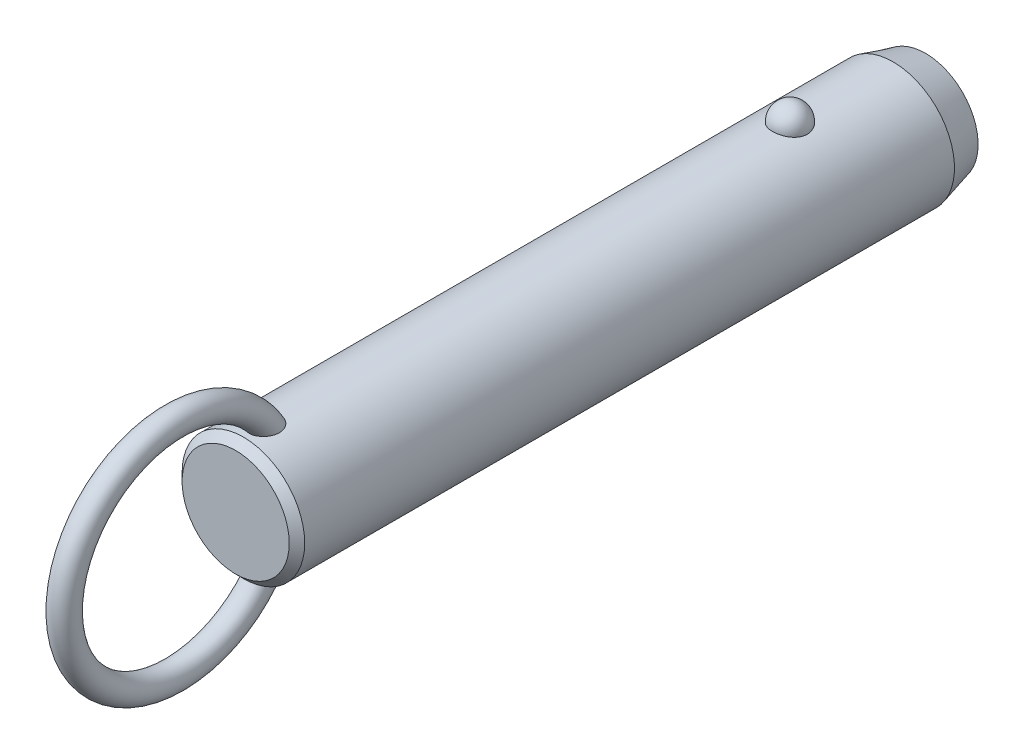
ISO-10303-21;
HEADER;
FILE_DESCRIPTION(('STEP AP214'),'2;1');
FILE_NAME('part.step','',(''),(''),'','','');
FILE_SCHEMA(('AUTOMOTIVE_DESIGN { 1 0 10303 214 1 1 1 1 }'));
ENDSEC;
DATA;
#1=APPLICATION_CONTEXT('core data for automotive mechanical design processes');
#2=APPLICATION_PROTOCOL_DEFINITION('international standard','automotive_design',2000,#1);
#3=PRODUCT_CONTEXT('',#1,'mechanical');
#4=PRODUCT('Part','Part','',(#3));
#5=PRODUCT_RELATED_PRODUCT_CATEGORY('part','',(#4));
#6=PRODUCT_DEFINITION_FORMATION('','',#4);
#7=PRODUCT_DEFINITION_CONTEXT('part definition',#1,'design');
#8=PRODUCT_DEFINITION('design','',#6,#7);
#9=PRODUCT_DEFINITION_SHAPE('','',#8);
#10=(LENGTH_UNIT() NAMED_UNIT(*) SI_UNIT(.MILLI.,.METRE.));
#11=(NAMED_UNIT(*) PLANE_ANGLE_UNIT() SI_UNIT($,.RADIAN.));
#12=(NAMED_UNIT(*) SI_UNIT($,.STERADIAN.) SOLID_ANGLE_UNIT());
#13=UNCERTAINTY_MEASURE_WITH_UNIT(LENGTH_MEASURE(1.E-05),#10,'distance_accuracy_value','');
#14=(GEOMETRIC_REPRESENTATION_CONTEXT(3) GLOBAL_UNCERTAINTY_ASSIGNED_CONTEXT((#13)) GLOBAL_UNIT_ASSIGNED_CONTEXT((#10,
#11,#12)) REPRESENTATION_CONTEXT('',''));
#15=CARTESIAN_POINT('',(0.,0.,0.));
#16=DIRECTION('',(0.,0.,1.));
#17=DIRECTION('',(1.,0.,0.));
#18=AXIS2_PLACEMENT_3D('',#15,#16,#17);
#19=CARTESIAN_POINT('',(0.,0.,73.7));
#20=DIRECTION('',(0.,0.,-1.));
#21=DIRECTION('',(-1.,0.,0.));
#22=AXIS2_PLACEMENT_3D('',#19,#20,#21);
#23=CYLINDRICAL_SURFACE('',#22,9.5);
#24=CARTESIAN_POINT('',(2.67259918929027,9.11631578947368,-2.70000000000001));
#25=CARTESIAN_POINT('',(2.6725968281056,9.11631786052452,-2.54909854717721));
#26=CARTESIAN_POINT('',(2.66030567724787,9.11994722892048,-2.39816735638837));
#27=CARTESIAN_POINT('',(2.6114347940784,9.13405924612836,-2.10058568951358));
#28=CARTESIAN_POINT('',(2.57484658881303,9.14454428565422,-1.95393672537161));
#29=CARTESIAN_POINT('',(2.47830875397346,9.17117631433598,-1.66916069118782));
#30=CARTESIAN_POINT('',(2.41836936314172,9.18732082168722,-1.53102991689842));
#31=CARTESIAN_POINT('',(2.27661331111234,9.22346780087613,-1.26705393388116));
#32=CARTESIAN_POINT('',(2.19479699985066,9.24347021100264,-1.14120852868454));
#33=CARTESIAN_POINT('',(2.01085282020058,9.28522401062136,-0.904632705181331));
#34=CARTESIAN_POINT('',(1.90862396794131,9.30698376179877,-0.793982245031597));
#35=CARTESIAN_POINT('',(1.6867437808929,9.34973971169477,-0.591607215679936));
#36=CARTESIAN_POINT('',(1.56709244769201,9.37073591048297,-0.499882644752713));
#37=CARTESIAN_POINT('',(1.31393976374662,9.40956370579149,-0.338167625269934));
#38=CARTESIAN_POINT('',(1.18048026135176,9.42740444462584,-0.268113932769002));
#39=CARTESIAN_POINT('',(0.903154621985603,9.45799906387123,-0.151390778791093));
#40=CARTESIAN_POINT('',(0.759289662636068,9.47075351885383,-0.104718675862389));
#41=CARTESIAN_POINT('',(0.468074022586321,9.48956256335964,-0.0367633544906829));
#42=CARTESIAN_POINT('',(0.320836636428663,9.49573643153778,-0.0150275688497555));
#43=CARTESIAN_POINT('',(0.0246714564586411,9.50112183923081,0.00396199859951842));
#44=CARTESIAN_POINT('',(-0.124256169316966,9.50033406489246,0.00121819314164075));
#45=CARTESIAN_POINT('',(-0.417264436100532,9.4919475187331,-0.0284441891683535));
#46=CARTESIAN_POINT('',(-0.56138413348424,9.48444885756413,-0.0550074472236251));
#47=CARTESIAN_POINT('',(-0.842986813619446,9.46357853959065,-0.131064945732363));
#48=CARTESIAN_POINT('',(-0.980469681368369,9.450206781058,-0.180559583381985));
#49=CARTESIAN_POINT('',(-1.24585005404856,9.41890822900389,-0.301476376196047));
#50=CARTESIAN_POINT('',(-1.37368611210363,9.40095498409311,-0.373026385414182));
#51=CARTESIAN_POINT('',(-1.61552738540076,9.36242964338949,-0.536025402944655));
#52=CARTESIAN_POINT('',(-1.72953116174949,9.34185727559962,-0.627476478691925));
#53=CARTESIAN_POINT('',(-1.9429225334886,9.29984568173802,-0.829844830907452));
#54=CARTESIAN_POINT('',(-2.04198021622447,9.27839736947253,-0.94110821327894));
#55=CARTESIAN_POINT('',(-2.22026460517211,9.23735994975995,-1.17883414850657));
#56=CARTESIAN_POINT('',(-2.29948985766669,9.21777097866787,-1.30529781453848));
#57=CARTESIAN_POINT('',(-2.43697287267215,9.18238994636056,-1.57158566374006));
#58=CARTESIAN_POINT('',(-2.49497068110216,9.16664569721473,-1.71155057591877));
#59=CARTESIAN_POINT('',(-2.5872073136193,9.14104303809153,-1.99961197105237));
#60=CARTESIAN_POINT('',(-2.62144683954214,9.13118445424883,-2.14770821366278));
#61=CARTESIAN_POINT('',(-2.66521466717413,9.11850622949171,-2.44715424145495));
#62=CARTESIAN_POINT('',(-2.67484831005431,9.11565658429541,-2.59848735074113));
#63=CARTESIAN_POINT('',(-2.66946735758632,9.11723375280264,-2.90067317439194));
#64=CARTESIAN_POINT('',(-2.65445345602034,9.12166036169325,-3.05152590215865));
#65=CARTESIAN_POINT('',(-2.60029711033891,9.13724422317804,-3.34766110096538));
#66=CARTESIAN_POINT('',(-2.56127978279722,9.14836656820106,-3.49296833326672));
#67=CARTESIAN_POINT('',(-2.46018844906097,9.17606676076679,-3.77477535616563));
#68=CARTESIAN_POINT('',(-2.39811349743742,9.1926448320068,-3.9112747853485));
#69=CARTESIAN_POINT('',(-2.25202303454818,9.22952198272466,-4.17244273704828));
#70=CARTESIAN_POINT('',(-2.16788714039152,9.24984129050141,-4.29704106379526));
#71=CARTESIAN_POINT('',(-1.9799408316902,9.29188255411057,-4.53013066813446));
#72=CARTESIAN_POINT('',(-1.87612963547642,9.31360456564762,-4.63862130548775));
#73=CARTESIAN_POINT('',(-1.65105429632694,9.35612959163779,-4.8369029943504));
#74=CARTESIAN_POINT('',(-1.52972405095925,9.37692871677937,-4.92661991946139));
#75=CARTESIAN_POINT('',(-1.27318250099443,9.41518970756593,-5.08429106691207));
#76=CARTESIAN_POINT('',(-1.13797219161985,9.432651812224,-5.15224684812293));
#77=CARTESIAN_POINT('',(-0.859280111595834,9.46208255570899,-5.26371827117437));
#78=CARTESIAN_POINT('',(-0.715925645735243,9.47411833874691,-5.30753421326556));
#79=CARTESIAN_POINT('',(-0.423550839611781,9.4916822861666,-5.37076321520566));
#80=CARTESIAN_POINT('',(-0.2745312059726,9.49721125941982,-5.39017930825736));
#81=CARTESIAN_POINT('',(0.0218446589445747,9.50110860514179,-5.40390587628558));
#82=CARTESIAN_POINT('',(0.16917707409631,9.49961381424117,-5.39869609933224));
#83=CARTESIAN_POINT('',(0.460808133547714,9.48993906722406,-5.36441955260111));
#84=CARTESIAN_POINT('',(0.605106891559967,9.48175936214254,-5.33535367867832));
#85=CARTESIAN_POINT('',(0.886027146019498,9.4596376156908,-5.25435587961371));
#86=CARTESIAN_POINT('',(1.02267710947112,9.44571881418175,-5.20251612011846));
#87=CARTESIAN_POINT('',(1.28523827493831,9.41358993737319,-5.07741549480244));
#88=CARTESIAN_POINT('',(1.41114877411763,9.39537958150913,-5.00415322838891));
#89=CARTESIAN_POINT('',(1.65085227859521,9.3562644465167,-4.83684599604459));
#90=CARTESIAN_POINT('',(1.76442346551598,9.33532178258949,-4.74249218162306));
#91=CARTESIAN_POINT('',(1.97425672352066,9.29321198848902,-4.53620389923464));
#92=CARTESIAN_POINT('',(2.07051582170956,9.27204482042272,-4.42426641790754));
#93=CARTESIAN_POINT('',(2.24490086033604,9.23139221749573,-4.18363183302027));
#94=CARTESIAN_POINT('',(2.32267019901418,9.21194380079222,-4.05466990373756));
#95=CARTESIAN_POINT('',(2.45584092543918,9.1773419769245,-3.78517836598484));
#96=CARTESIAN_POINT('',(2.5112497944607,9.16218713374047,-3.64465264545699));
#97=CARTESIAN_POINT('',(2.59380876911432,9.13913522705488,-3.37104301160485));
#98=CARTESIAN_POINT('',(2.62330266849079,9.13064624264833,-3.23871053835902));
#99=CARTESIAN_POINT('',(2.66269870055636,9.11923566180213,-2.97092664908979));
#100=CARTESIAN_POINT('',(2.67260130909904,9.11631393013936,-2.83547530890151));
#101=CARTESIAN_POINT('',(2.67259918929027,9.11631578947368,-2.70000000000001));
#102=B_SPLINE_CURVE_WITH_KNOTS('',3,(#24,#25,#26,#27,#28,#29,#30,#31,#32,#33,#34,#35,#36,#37,
#38,#39,#40,#41,#42,#43,#44,#45,#46,#47,#48,#49,#50,#51,#52,#53,#54,#55,#56,#57,#58,#59,#60,#61,
#62,#63,#64,#65,#66,#67,#68,#69,#70,#71,#72,#73,#74,#75,#76,#77,#78,#79,#80,#81,#82,#83,#84,#85,
#86,#87,#88,#89,#90,#91,#92,#93,#94,#95,#96,#97,#98,#99,#100,#101),.UNSPECIFIED.,.T.,.F.,(4,2,2,
2,2,2,2,2,2,2,2,2,2,2,2,2,2,2,2,2,2,2,2,2,2,2,2,2,2,2,2,2,2,2,2,2,2,2,4),(0.,0.452217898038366,
0.904593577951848,1.35677112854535,1.80894144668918,2.26340676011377,2.71787203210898,
3.17099820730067,3.62407318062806,4.0687883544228,4.51345969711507,4.95160616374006,
5.38976021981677,5.83050358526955,6.27129275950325,6.72071308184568,7.17016633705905,
7.62495278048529,8.07972578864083,8.53254856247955,8.98535859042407,9.43582813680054,
9.88631615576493,10.3393155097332,10.7923328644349,11.2471065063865,11.7018475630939,
12.150795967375,12.599688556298,13.0398725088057,13.4800399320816,13.9184421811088,
14.3568730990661,14.802202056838,15.2476074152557,15.7010097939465,16.1542603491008,
16.5602594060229,16.966248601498),.UNSPECIFIED.);
#103=CARTESIAN_POINT('',(2.67259918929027,9.11631578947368,-2.70000000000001));
#104=VERTEX_POINT('',#103);
#105=EDGE_CURVE('E41',#104,#104,#102,.T.);
#106=ORIENTED_EDGE('',*,*,#105,.T.);
#107=EDGE_LOOP('',(#106));
#108=FACE_BOUND('',#107,.T.);
#109=CARTESIAN_POINT('',(0.,0.,82.02));
#110=DIRECTION('',(0.,0.,1.));
#111=DIRECTION('',(1.,0.,0.));
#112=AXIS2_PLACEMENT_3D('',#109,#110,#111);
#113=CIRCLE('',#112,9.5);
#114=CARTESIAN_POINT('',(9.5,0.,82.02));
#115=VERTEX_POINT('',#114);
#116=EDGE_CURVE('E10',#115,#115,#113,.F.);
#117=ORIENTED_EDGE('',*,*,#116,.T.);
#118=EDGE_LOOP('',(#117));
#119=FACE_BOUND('',#118,.T.);
#120=CARTESIAN_POINT('',(-0.697062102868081,-9.47439269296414,76.3678088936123));
#121=CARTESIAN_POINT('',(-0.799579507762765,-9.46685146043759,76.4074823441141));
#122=CARTESIAN_POINT('',(-0.898575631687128,-9.45788043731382,76.4559309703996));
#123=CARTESIAN_POINT('',(-1.08670047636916,-9.43811593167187,76.5688685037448));
#124=CARTESIAN_POINT('',(-1.17583204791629,-9.42732297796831,76.633352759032));
#125=CARTESIAN_POINT('',(-1.34179806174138,-9.40513672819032,76.7762099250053));
#126=CARTESIAN_POINT('',(-1.41865133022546,-9.39374438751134,76.854561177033));
#127=CARTESIAN_POINT('',(-1.5586004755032,-9.37154196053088,77.0227524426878));
#128=CARTESIAN_POINT('',(-1.62169476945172,-9.3607319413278,77.1125937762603));
#129=CARTESIAN_POINT('',(-1.73527695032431,-9.34035749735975,77.3045001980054));
#130=CARTESIAN_POINT('',(-1.7852226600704,-9.33085270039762,77.4068910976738));
#131=CARTESIAN_POINT('',(-1.86924997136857,-9.3143834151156,77.618148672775));
#132=CARTESIAN_POINT('',(-1.90332570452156,-9.30741986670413,77.7270177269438));
#133=CARTESIAN_POINT('',(-1.95893603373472,-9.29588482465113,77.9604730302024));
#134=CARTESIAN_POINT('',(-1.97872420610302,-9.29165182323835,78.0854890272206));
#135=CARTESIAN_POINT('',(-2.00062129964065,-9.28695978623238,78.3370805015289));
#136=CARTESIAN_POINT('',(-2.00272284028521,-9.28650232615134,78.463656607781));
#137=CARTESIAN_POINT('',(-1.98958876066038,-9.28932750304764,78.7368157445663));
#138=CARTESIAN_POINT('',(-1.97143366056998,-9.2932400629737,78.8832519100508));
#139=CARTESIAN_POINT('',(-1.91479925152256,-9.30507151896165,79.1720629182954));
#140=CARTESIAN_POINT('',(-1.87629122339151,-9.31299607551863,79.314431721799));
#141=CARTESIAN_POINT('',(-1.77225683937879,-9.33340232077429,79.6151725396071));
#142=CARTESIAN_POINT('',(-1.70334898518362,-9.34641636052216,79.7723691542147));
#143=CARTESIAN_POINT('',(-1.58111062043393,-9.36759153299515,79.9975171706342));
#144=CARTESIAN_POINT('',(-1.53721459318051,-9.37492619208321,80.0707968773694));
#145=CARTESIAN_POINT('',(-1.44302631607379,-9.38988566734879,80.2130740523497));
#146=CARTESIAN_POINT('',(-1.39273721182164,-9.39751033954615,80.2820736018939));
#147=CARTESIAN_POINT('',(-1.26775962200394,-9.41530678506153,80.4369832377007));
#148=CARTESIAN_POINT('',(-1.19052326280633,-9.42548108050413,80.5208712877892));
#149=CARTESIAN_POINT('',(-1.02420241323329,-9.44499825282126,80.6760086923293));
#150=CARTESIAN_POINT('',(-0.935139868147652,-9.45434261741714,80.7472808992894));
#151=CARTESIAN_POINT('',(-0.766610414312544,-9.46930670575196,80.8586955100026));
#152=CARTESIAN_POINT('',(-0.689439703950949,-9.47529223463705,80.9022354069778));
#153=CARTESIAN_POINT('',(-0.528942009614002,-9.48560294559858,80.9763133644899));
#154=CARTESIAN_POINT('',(-0.445620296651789,-9.48992953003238,81.0068624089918));
#155=CARTESIAN_POINT('',(-0.273901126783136,-9.49644161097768,81.0525792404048));
#156=CARTESIAN_POINT('',(-0.185465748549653,-9.49860811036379,81.06761059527));
#157=CARTESIAN_POINT('',(-0.00734541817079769,-9.5004135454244,81.0801494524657));
#158=CARTESIAN_POINT('',(0.0823387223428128,-9.50005405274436,81.0776678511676));
#159=CARTESIAN_POINT('',(0.247679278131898,-9.49708301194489,81.0569959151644));
#160=CARTESIAN_POINT('',(0.323620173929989,-9.49477609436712,81.0409300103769));
#161=CARTESIAN_POINT('',(0.471981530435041,-9.48855917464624,80.9971726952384));
#162=CARTESIAN_POINT('',(0.544400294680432,-9.48464840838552,80.9694757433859));
#163=CARTESIAN_POINT('',(0.708947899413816,-9.47398336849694,80.8928026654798));
#164=CARTESIAN_POINT('',(0.799149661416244,-9.46671310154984,80.8397745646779));
#165=CARTESIAN_POINT('',(0.969783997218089,-9.45076225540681,80.7199731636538));
#166=CARTESIAN_POINT('',(1.05019415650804,-9.44207854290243,80.6531692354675));
#167=CARTESIAN_POINT('',(1.23092343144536,-9.42051459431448,80.4807596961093));
#168=CARTESIAN_POINT('',(1.32652499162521,-9.40733378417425,80.3702619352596));
#169=CARTESIAN_POINT('',(1.49893121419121,-9.38140745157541,80.1355614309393));
#170=CARTESIAN_POINT('',(1.57571616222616,-9.36866239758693,80.0113445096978));
#171=CARTESIAN_POINT('',(1.71285426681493,-9.34457644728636,79.7493891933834));
#172=CARTESIAN_POINT('',(1.77266365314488,-9.33328726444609,79.6113623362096));
#173=CARTESIAN_POINT('',(1.87239208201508,-9.31379209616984,79.3280515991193));
#174=CARTESIAN_POINT('',(1.91230158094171,-9.3055875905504,79.182764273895));
#175=CARTESIAN_POINT('',(1.9760418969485,-9.29228394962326,78.8620281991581));
#176=CARTESIAN_POINT('',(1.99587438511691,-9.28797202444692,78.6857248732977));
#177=CARTESIAN_POINT('',(2.0029570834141,-9.28645519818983,78.3324146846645));
#178=CARTESIAN_POINT('',(1.99025930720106,-9.28923895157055,78.1554093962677));
#179=CARTESIAN_POINT('',(1.93735479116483,-9.30038134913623,77.8563381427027));
#180=CARTESIAN_POINT('',(1.90576827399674,-9.30697680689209,77.7326679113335));
#181=CARTESIAN_POINT('',(1.82287484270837,-9.32356855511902,77.492329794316));
#182=CARTESIAN_POINT('',(1.77158213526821,-9.33356239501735,77.3756569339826));
#183=CARTESIAN_POINT('',(1.6488574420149,-9.35602275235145,77.1527061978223));
#184=CARTESIAN_POINT('',(1.57730995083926,-9.36850332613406,77.0464927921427));
#185=CARTESIAN_POINT('',(1.41543264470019,-9.39431873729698,76.8495530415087));
#186=CARTESIAN_POINT('',(1.32510883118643,-9.40765330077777,76.7588217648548));
#187=CARTESIAN_POINT('',(1.13846223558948,-9.43195720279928,76.6050334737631));
#188=CARTESIAN_POINT('',(1.0436989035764,-9.44302894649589,76.5400947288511));
#189=CARTESIAN_POINT('',(0.843965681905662,-9.46296805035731,76.4280388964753));
#190=CARTESIAN_POINT('',(0.739000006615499,-9.47183631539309,76.3809144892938));
#191=CARTESIAN_POINT('',(0.528175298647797,-9.48586140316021,76.3081173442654));
#192=CARTESIAN_POINT('',(0.422686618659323,-9.49119633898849,76.2814024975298));
#193=CARTESIAN_POINT('',(0.208590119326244,-9.49831365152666,76.2460137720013));
#194=CARTESIAN_POINT('',(0.0999817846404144,-9.500095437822,76.2373428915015));
#195=CARTESIAN_POINT('',(-0.126104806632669,-9.49988861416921,76.2383501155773));
#196=CARTESIAN_POINT('',(-0.243578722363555,-9.49757821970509,76.2495942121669));
#197=CARTESIAN_POINT('',(-0.474390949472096,-9.48885165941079,76.293167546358));
#198=CARTESIAN_POINT('',(-0.587729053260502,-9.48243528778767,76.3254978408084));
#199=CARTESIAN_POINT('',(-0.697062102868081,-9.47439269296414,76.3678088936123));
#200=B_SPLINE_CURVE_WITH_KNOTS('',3,(#120,#121,#122,#123,#124,#125,#126,#127,#128,#129,#130,
#131,#132,#133,#134,#135,#136,#137,#138,#139,#140,#141,#142,#143,#144,#145,#146,#147,#148,#149,
#150,#151,#152,#153,#154,#155,#156,#157,#158,#159,#160,#161,#162,#163,#164,#165,#166,#167,#168,
#169,#170,#171,#172,#173,#174,#175,#176,#177,#178,#179,#180,#181,#182,#183,#184,#185,#186,#187,
#188,#189,#190,#191,#192,#193,#194,#195,#196,#197,#198,#199),.UNSPECIFIED.,.T.,.F.,(4,2,2,2,2,2,
2,2,2,2,2,2,2,2,2,2,2,2,2,2,2,2,2,2,2,2,2,2,2,2,2,2,2,2,2,2,2,2,2,4),(0.,0.330119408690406,
0.660143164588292,0.989655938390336,1.31920659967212,1.66074728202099,2.00241415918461,
2.38088696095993,2.75951768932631,3.20065679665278,3.6424200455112,4.15620996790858,
4.41314162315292,4.66994734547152,5.01228664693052,5.35399933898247,5.6194303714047,
5.88463652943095,6.15215502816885,6.41950709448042,6.65144391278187,6.88349136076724,
7.19641200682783,7.51003602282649,7.9477971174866,8.38601491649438,8.83699707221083,
9.28819530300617,9.8177866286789,10.3465317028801,10.7284172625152,11.110028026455,
11.4938603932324,11.8775702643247,12.2220189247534,12.5663259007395,12.8915939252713,
13.2169159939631,13.5689650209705,13.9210316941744),.UNSPECIFIED.);
#201=CARTESIAN_POINT('',(-0.697062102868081,-9.47439269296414,76.3678088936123));
#202=VERTEX_POINT('',#201);
#203=EDGE_CURVE('E60',#202,#202,#200,.T.);
#204=ORIENTED_EDGE('',*,*,#203,.T.);
#205=EDGE_LOOP('',(#204));
#206=FACE_BOUND('',#205,.T.);
#207=CARTESIAN_POINT('',(-0.697062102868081,9.47439269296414,76.3678088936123));
#208=CARTESIAN_POINT('',(-0.597792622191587,9.48169483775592,76.3293956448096));
#209=CARTESIAN_POINT('',(-0.495106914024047,9.48766580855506,76.2991682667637));
#210=CARTESIAN_POINT('',(-0.285876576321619,9.49627648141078,76.2560327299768));
#211=CARTESIAN_POINT('',(-0.179324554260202,9.49890941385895,76.2431597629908));
#212=CARTESIAN_POINT('',(0.0344157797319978,9.50053798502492,76.2351666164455));
#213=CARTESIAN_POINT('',(0.141603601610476,9.49953613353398,76.2400341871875));
#214=CARTESIAN_POINT('',(0.353563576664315,9.49401038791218,76.2673654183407));
#215=CARTESIAN_POINT('',(0.458336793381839,9.48948807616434,76.28982117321));
#216=CARTESIAN_POINT('',(0.66249373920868,9.4774236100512,76.3516719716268));
#217=CARTESIAN_POINT('',(0.761881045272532,9.46988348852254,76.3910556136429));
#218=CARTESIAN_POINT('',(0.952608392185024,9.45260382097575,76.4856342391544));
#219=CARTESIAN_POINT('',(1.04394806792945,9.44286417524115,76.5408299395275));
#220=CARTESIAN_POINT('',(1.21712767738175,9.4221176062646,76.6660662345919));
#221=CARTESIAN_POINT('',(1.29885671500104,9.41109835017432,76.7362579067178));
#222=CARTESIAN_POINT('',(1.44978975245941,9.38903310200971,76.888980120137));
#223=CARTESIAN_POINT('',(1.51899278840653,9.37798710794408,76.9715116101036));
#224=CARTESIAN_POINT('',(1.64602857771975,9.35654375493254,77.1497763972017));
#225=CARTESIAN_POINT('',(1.70333052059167,9.34618688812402,77.2458916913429));
#226=CARTESIAN_POINT('',(1.80259341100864,9.32755128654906,77.445897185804));
#227=CARTESIAN_POINT('',(1.84454942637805,9.31927322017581,77.5497898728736));
#228=CARTESIAN_POINT('',(1.91637039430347,9.30478365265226,77.772213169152));
#229=CARTESIAN_POINT('',(1.944805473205,9.29882552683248,77.8912192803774));
#230=CARTESIAN_POINT('',(1.98449865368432,9.29043398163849,78.1321436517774));
#231=CARTESIAN_POINT('',(1.99574908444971,9.28800213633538,78.2540631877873));
#232=CARTESIAN_POINT('',(2.00275141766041,9.28649645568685,78.5169324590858));
#233=CARTESIAN_POINT('',(1.99588238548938,9.28799035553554,78.6579529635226));
#234=CARTESIAN_POINT('',(1.96270559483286,9.29505517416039,78.9376217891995));
#235=CARTESIAN_POINT('',(1.93637872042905,9.30063010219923,79.076267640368));
#236=CARTESIAN_POINT('',(1.85949176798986,9.31633564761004,79.3725616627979));
#237=CARTESIAN_POINT('',(1.80549792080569,9.3270926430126,79.5292907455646));
#238=CARTESIAN_POINT('',(1.67376869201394,9.35163064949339,79.8322840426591));
#239=CARTESIAN_POINT('',(1.59603181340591,9.36541185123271,79.9785475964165));
#240=CARTESIAN_POINT('',(1.4360277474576,9.39110706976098,80.2258138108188));
#241=CARTESIAN_POINT('',(1.35831795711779,9.40278656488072,80.329791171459));
#242=CARTESIAN_POINT('',(1.18774483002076,9.42585025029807,80.5245347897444));
#243=CARTESIAN_POINT('',(1.09490932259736,9.43723493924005,80.6153247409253));
#244=CARTESIAN_POINT('',(0.921110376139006,9.45552616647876,80.7562033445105));
#245=CARTESIAN_POINT('',(0.843738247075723,9.46281058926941,80.8106563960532));
#246=CARTESIAN_POINT('',(0.681245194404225,9.47589120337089,80.9067117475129));
#247=CARTESIAN_POINT('',(0.596135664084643,9.48168953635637,80.9483325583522));
#248=CARTESIAN_POINT('',(0.433779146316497,9.49038144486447,81.0100899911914));
#249=CARTESIAN_POINT('',(0.357459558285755,9.49359170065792,81.0326013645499));
#250=CARTESIAN_POINT('',(0.202074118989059,9.49816761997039,81.0645745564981));
#251=CARTESIAN_POINT('',(0.123010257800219,9.49953459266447,81.0740456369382));
#252=CARTESIAN_POINT('',(-0.0357372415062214,9.50026497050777,81.0791143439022));
#253=CARTESIAN_POINT('',(-0.115421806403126,9.49962433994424,81.0746840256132));
#254=CARTESIAN_POINT('',(-0.272823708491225,9.49640854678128,81.0522962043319));
#255=CARTESIAN_POINT('',(-0.350540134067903,9.4938325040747,81.0343325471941));
#256=CARTESIAN_POINT('',(-0.500580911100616,9.4870946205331,80.9868028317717));
#257=CARTESIAN_POINT('',(-0.572979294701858,9.48296359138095,80.9574618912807));
#258=CARTESIAN_POINT('',(-0.712864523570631,9.47347609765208,80.8890087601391));
#259=CARTESIAN_POINT('',(-0.780349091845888,9.46811906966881,80.8498920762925));
#260=CARTESIAN_POINT('',(-0.94630921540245,9.45329720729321,80.739432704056));
#261=CARTESIAN_POINT('',(-1.04090230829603,9.44321512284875,80.6623297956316));
#262=CARTESIAN_POINT('',(-1.21661929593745,9.42219227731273,80.4940971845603));
#263=CARTESIAN_POINT('',(-1.2977051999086,9.41124921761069,80.4029292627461));
#264=CARTESIAN_POINT('',(-1.47319646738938,9.38563439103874,80.1761621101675));
#265=CARTESIAN_POINT('',(-1.56208878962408,9.37102009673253,80.0362895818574));
#266=CARTESIAN_POINT('',(-1.71623987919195,9.34401559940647,79.7439503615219));
#267=CARTESIAN_POINT('',(-1.78147866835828,9.33162728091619,79.591473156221));
#268=CARTESIAN_POINT('',(-1.88853837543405,9.31055541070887,79.2756470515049));
#269=CARTESIAN_POINT('',(-1.92998995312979,9.30193076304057,79.1121685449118));
#270=CARTESIAN_POINT('',(-1.98590726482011,9.29015757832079,78.7805268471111));
#271=CARTESIAN_POINT('',(-2.0004070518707,9.2870021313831,78.6123698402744));
#272=CARTESIAN_POINT('',(-1.99964701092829,9.28716218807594,78.3050806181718));
#273=CARTESIAN_POINT('',(-1.9890814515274,9.28945704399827,78.1659362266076));
#274=CARTESIAN_POINT('',(-1.94566294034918,9.29865169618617,77.8911539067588));
#275=CARTESIAN_POINT('',(-1.9128206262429,9.30554929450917,77.755514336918));
#276=CARTESIAN_POINT('',(-1.84582133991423,9.31898248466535,77.5578026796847));
#277=CARTESIAN_POINT('',(-1.82038084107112,9.32400364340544,77.492583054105));
#278=CARTESIAN_POINT('',(-1.76350511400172,9.33492884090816,77.3649033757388));
#279=CARTESIAN_POINT('',(-1.73207305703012,9.34083241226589,77.3024418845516));
#280=CARTESIAN_POINT('',(-1.66324243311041,9.35333332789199,77.1809407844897));
#281=CARTESIAN_POINT('',(-1.625842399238,9.35993084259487,77.121902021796));
#282=CARTESIAN_POINT('',(-1.54527678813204,9.37356864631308,77.0079875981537));
#283=CARTESIAN_POINT('',(-1.50211241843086,9.38060884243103,76.9531110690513));
#284=CARTESIAN_POINT('',(-1.3768114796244,9.40004442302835,76.809961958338));
#285=CARTESIAN_POINT('',(-1.28916358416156,9.41261047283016,76.7264295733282));
#286=CARTESIAN_POINT('',(-1.09996826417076,9.43658180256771,76.5772360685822));
#287=CARTESIAN_POINT('',(-0.998461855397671,9.44799034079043,76.5115238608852));
#288=CARTESIAN_POINT('',(-0.860188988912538,9.46103017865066,76.4394367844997));
#289=CARTESIAN_POINT('',(-0.828141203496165,9.46389141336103,76.4238511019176));
#290=CARTESIAN_POINT('',(-0.763210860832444,9.46934915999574,76.3944734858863));
#291=CARTESIAN_POINT('',(-0.73032830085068,9.47194567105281,76.3806815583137));
#292=CARTESIAN_POINT('',(-0.697062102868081,9.47439269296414,76.3678088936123));
#293=B_SPLINE_CURVE_WITH_KNOTS('',3,(#207,#208,#209,#210,#211,#212,#213,#214,#215,#216,#217,
#218,#219,#220,#221,#222,#223,#224,#225,#226,#227,#228,#229,#230,#231,#232,#233,#234,#235,#236,
#237,#238,#239,#240,#241,#242,#243,#244,#245,#246,#247,#248,#249,#250,#251,#252,#253,#254,#255,
#256,#257,#258,#259,#260,#261,#262,#263,#264,#265,#266,#267,#268,#269,#270,#271,#272,#273,#274,
#275,#276,#277,#278,#279,#280,#281,#282,#283,#284,#285,#286,#287,#288,#289,#290,#291,#292),
.UNSPECIFIED.,.T.,.F.,(4,2,2,2,2,2,2,2,2,2,2,2,2,2,2,2,2,2,2,2,2,2,2,2,2,2,2,2,2,2,2,2,2,2,2,2,
2,2,2,2,2,2,4),(0.,0.319942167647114,0.640532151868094,0.960900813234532,1.28112555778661,
1.60113495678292,1.92115886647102,2.24457323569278,2.56801248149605,2.90371927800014,
3.23953387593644,3.60560313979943,3.97183576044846,4.393836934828,4.81625324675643,
5.31257045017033,5.80891895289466,6.19868344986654,6.58773876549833,6.87145417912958,
7.15475838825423,7.3926375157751,7.63034760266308,7.86853584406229,8.10683246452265,
8.3406366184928,8.57454843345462,8.93983939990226,9.30614105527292,9.80266668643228,
10.2996107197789,10.8040753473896,11.3079021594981,11.7249776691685,12.1418541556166,
12.3521485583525,12.5623319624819,12.7725671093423,12.9827582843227,13.345827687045,
13.7078449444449,13.8150604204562,13.9222762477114),.UNSPECIFIED.);
#294=CARTESIAN_POINT('',(-0.697062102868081,9.47439269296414,76.3678088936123));
#295=VERTEX_POINT('',#294);
#296=EDGE_CURVE('E68',#295,#295,#293,.T.);
#297=ORIENTED_EDGE('',*,*,#296,.T.);
#298=EDGE_LOOP('',(#297));
#299=FACE_BOUND('',#298,.T.);
#300=CARTESIAN_POINT('',(0.,0.,-18.6999999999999));
#301=DIRECTION('',(0.,0.,-1.));
#302=DIRECTION('',(-1.,0.,0.));
#303=AXIS2_PLACEMENT_3D('',#300,#301,#302);
#304=CIRCLE('',#303,9.5);
#305=CARTESIAN_POINT('',(-9.5,0.,-18.6999999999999));
#306=VERTEX_POINT('',#305);
#307=EDGE_CURVE('E57',#306,#306,#304,.F.);
#308=ORIENTED_EDGE('',*,*,#307,.T.);
#309=EDGE_LOOP('',(#308));
#310=FACE_BOUND('',#309,.T.);
#311=ADVANCED_FACE('F37',(#108,#119,#206,#299,#310),#23,.T.);
#312=CARTESIAN_POINT('',(0.,0.,-23.7));
#313=DIRECTION('',(0.,0.,-1.));
#314=DIRECTION('',(-1.,0.,0.));
#315=AXIS2_PLACEMENT_3D('',#312,#313,#314);
#316=PLANE('',#315);
#317=CARTESIAN_POINT('',(0.,0.,-23.7));
#318=DIRECTION('',(0.,0.,-1.));
#319=DIRECTION('',(-1.,0.,0.));
#320=AXIS2_PLACEMENT_3D('',#317,#318,#319);
#321=CIRCLE('',#320,8.16025403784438);
#322=CARTESIAN_POINT('',(-8.16025403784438,0.,-23.7));
#323=VERTEX_POINT('',#322);
#324=EDGE_CURVE('E67',#323,#323,#321,.T.);
#325=ORIENTED_EDGE('',*,*,#324,.T.);
#326=EDGE_LOOP('',(#325));
#327=FACE_BOUND('',#326,.T.);
#328=ADVANCED_FACE('F86',(#327),#316,.T.);
#329=CARTESIAN_POINT('',(0.,0.,-23.7));
#330=DIRECTION('',(0.,0.,1.));
#331=DIRECTION('',(1.,0.,0.));
#332=AXIS2_PLACEMENT_3D('',#329,#330,#331);
#333=CONICAL_SURFACE('',#332,8.16025403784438,0.261799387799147);
#334=ORIENTED_EDGE('',*,*,#307,.F.);
#335=EDGE_LOOP('',(#334));
#336=FACE_BOUND('',#335,.T.);
#337=ORIENTED_EDGE('',*,*,#324,.F.);
#338=EDGE_LOOP('',(#337));
#339=FACE_BOUND('',#338,.T.);
#340=ADVANCED_FACE('F84',(#336,#339),#333,.T.);
#341=CARTESIAN_POINT('',(0.,0.,83.22));
#342=DIRECTION('',(0.,0.,1.));
#343=DIRECTION('',(1.,0.,0.));
#344=AXIS2_PLACEMENT_3D('',#341,#342,#343);
#345=PLANE('',#344);
#346=CARTESIAN_POINT('',(0.,0.,83.22));
#347=DIRECTION('',(0.,0.,1.));
#348=DIRECTION('',(1.,0.,0.));
#349=AXIS2_PLACEMENT_3D('',#346,#347,#348);
#350=CIRCLE('',#349,8.29999999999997);
#351=CARTESIAN_POINT('',(8.29999999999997,0.,83.22));
#352=VERTEX_POINT('',#351);
#353=EDGE_CURVE('E50',#352,#352,#350,.T.);
#354=ORIENTED_EDGE('',*,*,#353,.T.);
#355=EDGE_LOOP('',(#354));
#356=FACE_BOUND('',#355,.T.);
#357=ADVANCED_FACE('F78',(#356),#345,.T.);
#358=CARTESIAN_POINT('',(0.,0.,92.75));
#359=DIRECTION('',(1.,0.,0.));
#360=DIRECTION('',(0.,0.,-1.));
#361=AXIS2_PLACEMENT_3D('',#358,#359,#360);
#362=TOROIDAL_SURFACE('',#361,17.05,2.);
#363=ORIENTED_EDGE('',*,*,#296,.F.);
#364=EDGE_LOOP('',(#363));
#365=FACE_BOUND('',#364,.T.);
#366=ORIENTED_EDGE('',*,*,#203,.F.);
#367=EDGE_LOOP('',(#366));
#368=FACE_BOUND('',#367,.T.);
#369=ADVANCED_FACE('F74',(#365,#368),#362,.T.);
#370=CARTESIAN_POINT('',(0.,0.,83.22));
#371=DIRECTION('',(0.,0.,-1.));
#372=DIRECTION('',(-1.,0.,0.));
#373=AXIS2_PLACEMENT_3D('',#370,#371,#372);
#374=CONICAL_SURFACE('',#373,8.29999999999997,0.785398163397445);
#375=ORIENTED_EDGE('',*,*,#116,.F.);
#376=EDGE_LOOP('',(#375));
#377=FACE_BOUND('',#376,.T.);
#378=ORIENTED_EDGE('',*,*,#353,.F.);
#379=EDGE_LOOP('',(#378));
#380=FACE_BOUND('',#379,.T.);
#381=ADVANCED_FACE('F39',(#377,#380),#374,.T.);
#382=CARTESIAN_POINT('',(0.,9.5,-2.70000000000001));
#383=DIRECTION('',(0.,1.,0.));
#384=DIRECTION('',(0.,0.,-1.));
#385=AXIS2_PLACEMENT_3D('',#382,#383,#384);
#386=SPHERICAL_SURFACE('',#385,2.7);
#387=ORIENTED_EDGE('',*,*,#105,.F.);
#388=EDGE_LOOP('',(#387));
#389=FACE_BOUND('',#388,.T.);
#390=ADVANCED_FACE('F80',(#389),#386,.T.);
#391=CLOSED_SHELL('',(#311,#328,#340,#357,#369,#381,#390));
#392=MANIFOLD_SOLID_BREP('B2',#391);
#393=ADVANCED_BREP_SHAPE_REPRESENTATION('',(#18,#392),#14);
#394=SHAPE_DEFINITION_REPRESENTATION(#9,#393);
ENDSEC;
END-ISO-10303-21;
